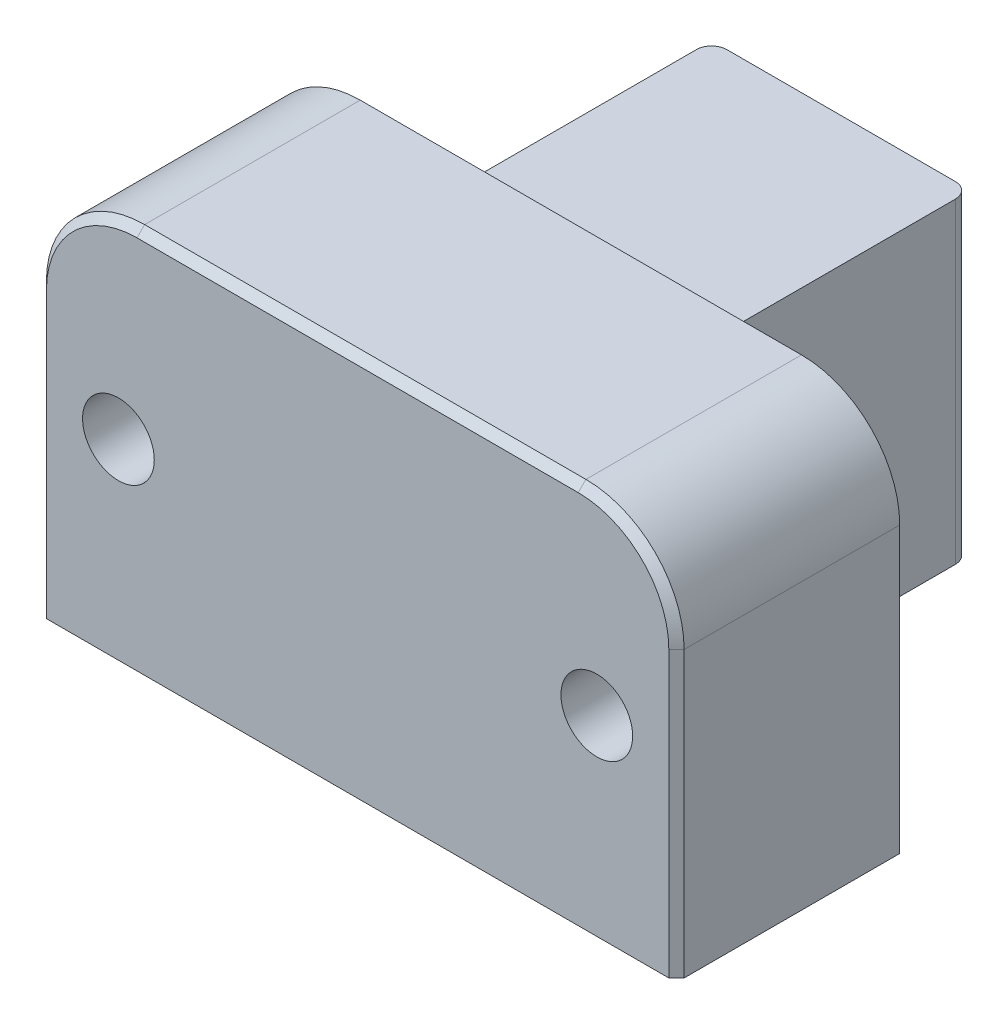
ISO-10303-21;
HEADER;
FILE_DESCRIPTION(('STEP AP214'),'2;1');
FILE_NAME('part.step','',(''),(''),'','','');
FILE_SCHEMA(('AUTOMOTIVE_DESIGN { 1 0 10303 214 1 1 1 1 }'));
ENDSEC;
DATA;
#1=APPLICATION_CONTEXT('core data for automotive mechanical design processes');
#2=APPLICATION_PROTOCOL_DEFINITION('international standard','automotive_design',2000,#1);
#3=PRODUCT_CONTEXT('',#1,'mechanical');
#4=PRODUCT('Part','Part','',(#3));
#5=PRODUCT_RELATED_PRODUCT_CATEGORY('part','',(#4));
#6=PRODUCT_DEFINITION_FORMATION('','',#4);
#7=PRODUCT_DEFINITION_CONTEXT('part definition',#1,'design');
#8=PRODUCT_DEFINITION('design','',#6,#7);
#9=PRODUCT_DEFINITION_SHAPE('','',#8);
#10=(LENGTH_UNIT() NAMED_UNIT(*) SI_UNIT(.MILLI.,.METRE.));
#11=(NAMED_UNIT(*) PLANE_ANGLE_UNIT() SI_UNIT($,.RADIAN.));
#12=(NAMED_UNIT(*) SI_UNIT($,.STERADIAN.) SOLID_ANGLE_UNIT());
#13=UNCERTAINTY_MEASURE_WITH_UNIT(LENGTH_MEASURE(1.E-05),#10,'distance_accuracy_value','');
#14=(GEOMETRIC_REPRESENTATION_CONTEXT(3) GLOBAL_UNCERTAINTY_ASSIGNED_CONTEXT((#13)) GLOBAL_UNIT_ASSIGNED_CONTEXT((#10,
#11,#12)) REPRESENTATION_CONTEXT('',''));
#15=CARTESIAN_POINT('',(0.,0.,0.));
#16=DIRECTION('',(0.,0.,1.));
#17=DIRECTION('',(1.,0.,0.));
#18=AXIS2_PLACEMENT_3D('',#15,#16,#17);
#19=CARTESIAN_POINT('',(-31.74365,38.1,0.));
#20=DIRECTION('',(1.,0.,0.));
#21=DIRECTION('',(0.,0.,-1.));
#22=AXIS2_PLACEMENT_3D('',#19,#20,#21);
#23=PLANE('',#22);
#24=DIRECTION('',(0.,0.,1.));
#25=VECTOR('',#24,1.);
#26=CARTESIAN_POINT('',(-31.74365,0.,0.));
#27=LINE('',#26,#25);
#28=CARTESIAN_POINT('',(-31.74365,0.,0.));
#29=VERTEX_POINT('',#28);
#30=CARTESIAN_POINT('',(-31.74365,0.,21.463));
#31=VERTEX_POINT('',#30);
#32=EDGE_CURVE('E178',#29,#31,#27,.T.);
#33=ORIENTED_EDGE('',*,*,#32,.T.);
#34=DIRECTION('',(0.,1.,0.));
#35=VECTOR('',#34,1.);
#36=CARTESIAN_POINT('',(-31.74365,38.1,21.463));
#37=LINE('',#36,#35);
#38=CARTESIAN_POINT('',(-31.74365,28.321,21.463));
#39=VERTEX_POINT('',#38);
#40=EDGE_CURVE('E252',#31,#39,#37,.T.);
#41=ORIENTED_EDGE('',*,*,#40,.T.);
#42=DIRECTION('',(0.,0.,1.));
#43=VECTOR('',#42,1.);
#44=CARTESIAN_POINT('',(-31.74365,28.321,0.));
#45=LINE('',#44,#43);
#46=CARTESIAN_POINT('',(-31.74365,28.321,0.));
#47=VERTEX_POINT('',#46);
#48=EDGE_CURVE('E235',#39,#47,#45,.F.);
#49=ORIENTED_EDGE('',*,*,#48,.T.);
#50=DIRECTION('',(0.,-1.,0.));
#51=VECTOR('',#50,1.);
#52=CARTESIAN_POINT('',(-31.74365,38.1,0.));
#53=LINE('',#52,#51);
#54=EDGE_CURVE('E173',#47,#29,#53,.T.);
#55=ORIENTED_EDGE('',*,*,#54,.T.);
#56=EDGE_LOOP('',(#33,#41,#49,#55));
#57=FACE_BOUND('',#56,.T.);
#58=ADVANCED_FACE('F32',(#57),#23,.F.);
#59=CARTESIAN_POINT('',(-31.74365,38.1,22.225));
#60=DIRECTION('',(0.,0.,-1.));
#61=DIRECTION('',(-1.,0.,0.));
#62=AXIS2_PLACEMENT_3D('',#59,#60,#61);
#63=PLANE('',#62);
#64=CARTESIAN_POINT('',(23.8125,19.05,22.225));
#65=DIRECTION('',(0.,0.,-1.));
#66=DIRECTION('',(-1.,0.,0.));
#67=AXIS2_PLACEMENT_3D('',#64,#65,#66);
#68=CIRCLE('',#67,3.5687);
#69=CARTESIAN_POINT('',(20.2438,19.05,22.225));
#70=VERTEX_POINT('',#69);
#71=EDGE_CURVE('E284',#70,#70,#68,.T.);
#72=ORIENTED_EDGE('',*,*,#71,.T.);
#73=EDGE_LOOP('',(#72));
#74=FACE_BOUND('',#73,.T.);
#75=CARTESIAN_POINT('',(-23.8125,19.05,22.225));
#76=DIRECTION('',(0.,0.,1.));
#77=DIRECTION('',(1.,0.,0.));
#78=AXIS2_PLACEMENT_3D('',#75,#76,#77);
#79=CIRCLE('',#78,3.5687);
#80=CARTESIAN_POINT('',(-20.2438,19.05,22.225));
#81=VERTEX_POINT('',#80);
#82=EDGE_CURVE('E296',#81,#81,#79,.T.);
#83=ORIENTED_EDGE('',*,*,#82,.F.);
#84=EDGE_LOOP('',(#83));
#85=FACE_BOUND('',#84,.T.);
#86=CARTESIAN_POINT('',(-21.96465,28.321,22.225));
#87=DIRECTION('',(0.,0.,-1.));
#88=DIRECTION('',(-1.,0.,0.));
#89=AXIS2_PLACEMENT_3D('',#86,#87,#88);
#90=CIRCLE('',#89,9.017);
#91=CARTESIAN_POINT('',(-21.96465,37.338,22.225));
#92=VERTEX_POINT('',#91);
#93=CARTESIAN_POINT('',(-30.98165,28.321,22.225));
#94=VERTEX_POINT('',#93);
#95=EDGE_CURVE('E243',#92,#94,#90,.F.);
#96=ORIENTED_EDGE('',*,*,#95,.T.);
#97=DIRECTION('',(0.,-1.,0.));
#98=VECTOR('',#97,1.);
#99=CARTESIAN_POINT('',(-30.98165,38.1,22.225));
#100=LINE('',#99,#98);
#101=CARTESIAN_POINT('',(-30.98165,0.,22.225));
#102=VERTEX_POINT('',#101);
#103=EDGE_CURVE('E245',#94,#102,#100,.T.);
#104=ORIENTED_EDGE('',*,*,#103,.T.);
#105=DIRECTION('',(1.,0.,0.));
#106=VECTOR('',#105,1.);
#107=CARTESIAN_POINT('',(-31.74365,0.,22.225));
#108=LINE('',#107,#106);
#109=CARTESIAN_POINT('',(30.98165,0.,22.225));
#110=VERTEX_POINT('',#109);
#111=EDGE_CURVE('E162',#102,#110,#108,.T.);
#112=ORIENTED_EDGE('',*,*,#111,.T.);
#113=DIRECTION('',(0.,1.,0.));
#114=VECTOR('',#113,1.);
#115=CARTESIAN_POINT('',(30.98165,38.1,22.225));
#116=LINE('',#115,#114);
#117=CARTESIAN_POINT('',(30.98165,28.321,22.225));
#118=VERTEX_POINT('',#117);
#119=EDGE_CURVE('E237',#110,#118,#116,.T.);
#120=ORIENTED_EDGE('',*,*,#119,.T.);
#121=CARTESIAN_POINT('',(21.96465,28.321,22.225));
#122=DIRECTION('',(0.,0.,-1.));
#123=DIRECTION('',(-1.,0.,0.));
#124=AXIS2_PLACEMENT_3D('',#121,#122,#123);
#125=CIRCLE('',#124,9.017);
#126=CARTESIAN_POINT('',(21.96465,37.338,22.225));
#127=VERTEX_POINT('',#126);
#128=EDGE_CURVE('E239',#118,#127,#125,.F.);
#129=ORIENTED_EDGE('',*,*,#128,.T.);
#130=DIRECTION('',(-1.,0.,0.));
#131=VECTOR('',#130,1.);
#132=CARTESIAN_POINT('',(-21.96465,37.338,22.225));
#133=LINE('',#132,#131);
#134=EDGE_CURVE('E241',#127,#92,#133,.T.);
#135=ORIENTED_EDGE('',*,*,#134,.T.);
#136=EDGE_LOOP('',(#96,#104,#112,#120,#129,#135));
#137=FACE_BOUND('',#136,.T.);
#138=ADVANCED_FACE('F322',(#74,#85,#137),#63,.F.);
#139=CARTESIAN_POINT('',(31.74365,38.1,0.));
#140=DIRECTION('',(-1.,0.,0.));
#141=DIRECTION('',(0.,0.,1.));
#142=AXIS2_PLACEMENT_3D('',#139,#140,#141);
#143=PLANE('',#142);
#144=DIRECTION('',(0.,0.,-1.));
#145=VECTOR('',#144,1.);
#146=CARTESIAN_POINT('',(31.74365,28.321,22.225));
#147=LINE('',#146,#145);
#148=CARTESIAN_POINT('',(31.74365,28.321,0.));
#149=VERTEX_POINT('',#148);
#150=CARTESIAN_POINT('',(31.74365,28.321,21.463));
#151=VERTEX_POINT('',#150);
#152=EDGE_CURVE('E233',#149,#151,#147,.F.);
#153=ORIENTED_EDGE('',*,*,#152,.T.);
#154=DIRECTION('',(0.,-1.,0.));
#155=VECTOR('',#154,1.);
#156=CARTESIAN_POINT('',(31.74365,38.1,21.463));
#157=LINE('',#156,#155);
#158=CARTESIAN_POINT('',(31.74365,0.,21.463));
#159=VERTEX_POINT('',#158);
#160=EDGE_CURVE('E11',#151,#159,#157,.T.);
#161=ORIENTED_EDGE('',*,*,#160,.T.);
#162=DIRECTION('',(0.,0.,-1.));
#163=VECTOR('',#162,1.);
#164=CARTESIAN_POINT('',(31.74365,0.,0.));
#165=LINE('',#164,#163);
#166=CARTESIAN_POINT('',(31.74365,0.,0.));
#167=VERTEX_POINT('',#166);
#168=EDGE_CURVE('E153',#159,#167,#165,.T.);
#169=ORIENTED_EDGE('',*,*,#168,.T.);
#170=DIRECTION('',(0.,-1.,0.));
#171=VECTOR('',#170,1.);
#172=CARTESIAN_POINT('',(31.74365,38.1,0.));
#173=LINE('',#172,#171);
#174=EDGE_CURVE('E156',#149,#167,#173,.T.);
#175=ORIENTED_EDGE('',*,*,#174,.F.);
#176=EDGE_LOOP('',(#153,#161,#169,#175));
#177=FACE_BOUND('',#176,.T.);
#178=ADVANCED_FACE('F155',(#177),#143,.F.);
#179=CARTESIAN_POINT('',(12.8905,38.1,-25.908));
#180=DIRECTION('',(-1.,0.,0.));
#181=DIRECTION('',(0.,0.,1.));
#182=AXIS2_PLACEMENT_3D('',#179,#180,#181);
#183=PLANE('',#182);
#184=DIRECTION('',(0.,0.,1.));
#185=VECTOR('',#184,1.);
#186=CARTESIAN_POINT('',(12.8905,34.798,-25.908));
#187=LINE('',#186,#185);
#188=CARTESIAN_POINT('',(12.8905,34.798,-24.384));
#189=VERTEX_POINT('',#188);
#190=CARTESIAN_POINT('',(12.8905,34.798,-0.787400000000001));
#191=VERTEX_POINT('',#190);
#192=EDGE_CURVE('E306',#189,#191,#187,.T.);
#193=ORIENTED_EDGE('',*,*,#192,.T.);
#194=DIRECTION('',(0.,-1.,0.));
#195=VECTOR('',#194,1.);
#196=CARTESIAN_POINT('',(12.8905,3.30199999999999,-0.787400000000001));
#197=LINE('',#196,#195);
#198=CARTESIAN_POINT('',(12.8905,3.302,-0.787400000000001));
#199=VERTEX_POINT('',#198);
#200=EDGE_CURVE('E213',#191,#199,#197,.T.);
#201=ORIENTED_EDGE('',*,*,#200,.T.);
#202=DIRECTION('',(0.,0.,-1.));
#203=VECTOR('',#202,1.);
#204=CARTESIAN_POINT('',(12.8905,3.302,-25.908));
#205=LINE('',#204,#203);
#206=CARTESIAN_POINT('',(12.8905,3.302,-24.384));
#207=VERTEX_POINT('',#206);
#208=EDGE_CURVE('E317',#199,#207,#205,.T.);
#209=ORIENTED_EDGE('',*,*,#208,.T.);
#210=DIRECTION('',(0.,-1.,0.));
#211=VECTOR('',#210,1.);
#212=CARTESIAN_POINT('',(12.8905,38.1,-24.384));
#213=LINE('',#212,#211);
#214=EDGE_CURVE('E195',#207,#189,#213,.F.);
#215=ORIENTED_EDGE('',*,*,#214,.T.);
#216=EDGE_LOOP('',(#193,#201,#209,#215));
#217=FACE_BOUND('',#216,.T.);
#218=ADVANCED_FACE('F400',(#217),#183,.F.);
#219=CARTESIAN_POINT('',(-12.8905,38.1,-25.908));
#220=DIRECTION('',(0.,0.,1.));
#221=DIRECTION('',(1.,0.,0.));
#222=AXIS2_PLACEMENT_3D('',#219,#220,#221);
#223=PLANE('',#222);
#224=DIRECTION('',(1.,0.,0.));
#225=VECTOR('',#224,1.);
#226=CARTESIAN_POINT('',(-12.8905,34.798,-25.908));
#227=LINE('',#226,#225);
#228=CARTESIAN_POINT('',(-11.3665,34.798,-25.908));
#229=VERTEX_POINT('',#228);
#230=CARTESIAN_POINT('',(11.3665,34.798,-25.908));
#231=VERTEX_POINT('',#230);
#232=EDGE_CURVE('E303',#229,#231,#227,.T.);
#233=ORIENTED_EDGE('',*,*,#232,.T.);
#234=DIRECTION('',(0.,-1.,0.));
#235=VECTOR('',#234,1.);
#236=CARTESIAN_POINT('',(11.3665,38.1,-25.908));
#237=LINE('',#236,#235);
#238=CARTESIAN_POINT('',(11.3665,3.302,-25.908));
#239=VERTEX_POINT('',#238);
#240=EDGE_CURVE('E187',#231,#239,#237,.T.);
#241=ORIENTED_EDGE('',*,*,#240,.T.);
#242=DIRECTION('',(-1.,0.,0.));
#243=VECTOR('',#242,1.);
#244=CARTESIAN_POINT('',(-12.8905,3.302,-25.908));
#245=LINE('',#244,#243);
#246=CARTESIAN_POINT('',(-11.3665,3.302,-25.908));
#247=VERTEX_POINT('',#246);
#248=EDGE_CURVE('E314',#239,#247,#245,.T.);
#249=ORIENTED_EDGE('',*,*,#248,.T.);
#250=DIRECTION('',(0.,-1.,0.));
#251=VECTOR('',#250,1.);
#252=CARTESIAN_POINT('',(-11.3665,38.1,-25.908));
#253=LINE('',#252,#251);
#254=EDGE_CURVE('E172',#247,#229,#253,.F.);
#255=ORIENTED_EDGE('',*,*,#254,.T.);
#256=EDGE_LOOP('',(#233,#241,#249,#255));
#257=FACE_BOUND('',#256,.T.);
#258=ADVANCED_FACE('F405',(#257),#223,.F.);
#259=CARTESIAN_POINT('',(-12.8905,38.1,-25.908));
#260=DIRECTION('',(1.,0.,0.));
#261=DIRECTION('',(0.,0.,-1.));
#262=AXIS2_PLACEMENT_3D('',#259,#260,#261);
#263=PLANE('',#262);
#264=DIRECTION('',(0.,0.,1.));
#265=VECTOR('',#264,1.);
#266=CARTESIAN_POINT('',(-12.8905,3.302,-25.908));
#267=LINE('',#266,#265);
#268=CARTESIAN_POINT('',(-12.8905,3.302,-24.384));
#269=VERTEX_POINT('',#268);
#270=CARTESIAN_POINT('',(-12.8905,3.302,-0.787400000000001));
#271=VERTEX_POINT('',#270);
#272=EDGE_CURVE('E311',#269,#271,#267,.T.);
#273=ORIENTED_EDGE('',*,*,#272,.T.);
#274=DIRECTION('',(0.,-1.,0.));
#275=VECTOR('',#274,1.);
#276=CARTESIAN_POINT('',(-12.8905,34.798,-0.7874));
#277=LINE('',#276,#275);
#278=CARTESIAN_POINT('',(-12.8905,34.798,-0.787400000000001));
#279=VERTEX_POINT('',#278);
#280=EDGE_CURVE('E211',#271,#279,#277,.F.);
#281=ORIENTED_EDGE('',*,*,#280,.T.);
#282=DIRECTION('',(0.,0.,-1.));
#283=VECTOR('',#282,1.);
#284=CARTESIAN_POINT('',(-12.8905,34.798,-25.908));
#285=LINE('',#284,#283);
#286=CARTESIAN_POINT('',(-12.8905,34.798,-24.384));
#287=VERTEX_POINT('',#286);
#288=EDGE_CURVE('E301',#279,#287,#285,.T.);
#289=ORIENTED_EDGE('',*,*,#288,.T.);
#290=DIRECTION('',(0.,-1.,0.));
#291=VECTOR('',#290,1.);
#292=CARTESIAN_POINT('',(-12.8905,38.1,-24.384));
#293=LINE('',#292,#291);
#294=EDGE_CURVE('E202',#287,#269,#293,.T.);
#295=ORIENTED_EDGE('',*,*,#294,.T.);
#296=EDGE_LOOP('',(#273,#281,#289,#295));
#297=FACE_BOUND('',#296,.T.);
#298=ADVANCED_FACE('F389',(#297),#263,.F.);
#299=CARTESIAN_POINT('',(-31.74365,38.1,0.));
#300=DIRECTION('',(0.,0.,1.));
#301=DIRECTION('',(1.,0.,0.));
#302=AXIS2_PLACEMENT_3D('',#299,#300,#301);
#303=PLANE('',#302);
#304=CARTESIAN_POINT('',(23.8125,19.05,0.));
#305=DIRECTION('',(0.,0.,-1.));
#306=DIRECTION('',(-1.,0.,0.));
#307=AXIS2_PLACEMENT_3D('',#304,#305,#306);
#308=CIRCLE('',#307,5.1562);
#309=CARTESIAN_POINT('',(18.6563,19.05,0.));
#310=VERTEX_POINT('',#309);
#311=EDGE_CURVE('E269',#310,#310,#308,.T.);
#312=ORIENTED_EDGE('',*,*,#311,.F.);
#313=EDGE_LOOP('',(#312));
#314=FACE_BOUND('',#313,.T.);
#315=CARTESIAN_POINT('',(-23.8125,19.05,0.));
#316=DIRECTION('',(0.,0.,1.));
#317=DIRECTION('',(1.,0.,0.));
#318=AXIS2_PLACEMENT_3D('',#315,#316,#317);
#319=CIRCLE('',#318,5.1562);
#320=CARTESIAN_POINT('',(-18.6563,19.05,0.));
#321=VERTEX_POINT('',#320);
#322=EDGE_CURVE('E287',#321,#321,#319,.T.);
#323=ORIENTED_EDGE('',*,*,#322,.T.);
#324=EDGE_LOOP('',(#323));
#325=FACE_BOUND('',#324,.T.);
#326=DIRECTION('',(0.,-1.,0.));
#327=VECTOR('',#326,1.);
#328=CARTESIAN_POINT('',(-13.6779,3.30199999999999,0.));
#329=LINE('',#328,#327);
#330=CARTESIAN_POINT('',(-13.6779,34.798,0.));
#331=VERTEX_POINT('',#330);
#332=CARTESIAN_POINT('',(-13.6779,3.30199999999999,0.));
#333=VERTEX_POINT('',#332);
#334=EDGE_CURVE('E208',#331,#333,#329,.T.);
#335=ORIENTED_EDGE('',*,*,#334,.T.);
#336=DIRECTION('',(1.,0.,0.));
#337=VECTOR('',#336,1.);
#338=CARTESIAN_POINT('',(-25.4,3.30199999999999,0.));
#339=LINE('',#338,#337);
#340=CARTESIAN_POINT('',(13.6779,3.30199999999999,0.));
#341=VERTEX_POINT('',#340);
#342=EDGE_CURVE('E309',#333,#341,#339,.T.);
#343=ORIENTED_EDGE('',*,*,#342,.T.);
#344=DIRECTION('',(0.,-1.,0.));
#345=VECTOR('',#344,1.);
#346=CARTESIAN_POINT('',(13.6779,34.798,0.));
#347=LINE('',#346,#345);
#348=CARTESIAN_POINT('',(13.6779,34.798,0.));
#349=VERTEX_POINT('',#348);
#350=EDGE_CURVE('E205',#341,#349,#347,.F.);
#351=ORIENTED_EDGE('',*,*,#350,.T.);
#352=DIRECTION('',(1.,0.,0.));
#353=VECTOR('',#352,1.);
#354=CARTESIAN_POINT('',(-25.4,34.798,0.));
#355=LINE('',#354,#353);
#356=EDGE_CURVE('E299',#331,#349,#355,.T.);
#357=ORIENTED_EDGE('',*,*,#356,.F.);
#358=EDGE_LOOP('',(#335,#343,#351,#357));
#359=FACE_BOUND('',#358,.T.);
#360=DIRECTION('',(-1.,0.,0.));
#361=VECTOR('',#360,1.);
#362=CARTESIAN_POINT('',(12.8905,38.1,0.));
#363=LINE('',#362,#361);
#364=CARTESIAN_POINT('',(21.96465,38.1,0.));
#365=VERTEX_POINT('',#364);
#366=CARTESIAN_POINT('',(-21.96465,38.1,0.));
#367=VERTEX_POINT('',#366);
#368=EDGE_CURVE('E179',#365,#367,#363,.T.);
#369=ORIENTED_EDGE('',*,*,#368,.F.);
#370=CARTESIAN_POINT('',(21.96465,28.321,0.));
#371=DIRECTION('',(0.,0.,1.));
#372=DIRECTION('',(1.,0.,0.));
#373=AXIS2_PLACEMENT_3D('',#370,#371,#372);
#374=CIRCLE('',#373,9.779);
#375=EDGE_CURVE('E171',#365,#149,#374,.F.);
#376=ORIENTED_EDGE('',*,*,#375,.T.);
#377=ORIENTED_EDGE('',*,*,#174,.T.);
#378=DIRECTION('',(-1.,0.,0.));
#379=VECTOR('',#378,1.);
#380=CARTESIAN_POINT('',(-31.74365,0.,0.));
#381=LINE('',#380,#379);
#382=EDGE_CURVE('E161',#167,#29,#381,.T.);
#383=ORIENTED_EDGE('',*,*,#382,.T.);
#384=ORIENTED_EDGE('',*,*,#54,.F.);
#385=CARTESIAN_POINT('',(-21.96465,28.321,0.));
#386=DIRECTION('',(0.,0.,1.));
#387=DIRECTION('',(1.,0.,0.));
#388=AXIS2_PLACEMENT_3D('',#385,#386,#387);
#389=CIRCLE('',#388,9.779);
#390=EDGE_CURVE('E230',#47,#367,#389,.F.);
#391=ORIENTED_EDGE('',*,*,#390,.T.);
#392=EDGE_LOOP('',(#369,#376,#377,#383,#384,#391));
#393=FACE_BOUND('',#392,.T.);
#394=ADVANCED_FACE('F167',(#314,#325,#359,#393),#303,.F.);
#395=CARTESIAN_POINT('',(-31.74365,38.1,22.225));
#396=DIRECTION('',(0.,1.,0.));
#397=DIRECTION('',(0.,0.,1.));
#398=AXIS2_PLACEMENT_3D('',#395,#396,#397);
#399=PLANE('',#398);
#400=DIRECTION('',(0.,0.,1.));
#401=VECTOR('',#400,1.);
#402=CARTESIAN_POINT('',(-21.96465,38.1,22.225));
#403=LINE('',#402,#401);
#404=CARTESIAN_POINT('',(-21.96465,38.1,21.463));
#405=VERTEX_POINT('',#404);
#406=EDGE_CURVE('E226',#367,#405,#403,.T.);
#407=ORIENTED_EDGE('',*,*,#406,.T.);
#408=DIRECTION('',(1.,0.,0.));
#409=VECTOR('',#408,1.);
#410=CARTESIAN_POINT('',(21.96465,38.1,21.463));
#411=LINE('',#410,#409);
#412=CARTESIAN_POINT('',(21.96465,38.1,21.463));
#413=VERTEX_POINT('',#412);
#414=EDGE_CURVE('E56',#405,#413,#411,.T.);
#415=ORIENTED_EDGE('',*,*,#414,.T.);
#416=DIRECTION('',(0.,0.,-1.));
#417=VECTOR('',#416,1.);
#418=CARTESIAN_POINT('',(21.96465,38.1,0.));
#419=LINE('',#418,#417);
#420=EDGE_CURVE('E228',#413,#365,#419,.T.);
#421=ORIENTED_EDGE('',*,*,#420,.T.);
#422=ORIENTED_EDGE('',*,*,#368,.T.);
#423=EDGE_LOOP('',(#407,#415,#421,#422));
#424=FACE_BOUND('',#423,.T.);
#425=ADVANCED_FACE('F342',(#424),#399,.T.);
#426=CARTESIAN_POINT('',(-31.74365,0.,22.225));
#427=DIRECTION('',(0.,1.,0.));
#428=DIRECTION('',(0.,0.,1.));
#429=AXIS2_PLACEMENT_3D('',#426,#427,#428);
#430=PLANE('',#429);
#431=ORIENTED_EDGE('',*,*,#111,.F.);
#432=DIRECTION('',(0.707106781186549,0.,0.707106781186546));
#433=VECTOR('',#432,1.);
#434=CARTESIAN_POINT('',(-30.98165,0.,22.225));
#435=LINE('',#434,#433);
#436=EDGE_CURVE('E250',#102,#31,#435,.F.);
#437=ORIENTED_EDGE('',*,*,#436,.T.);
#438=ORIENTED_EDGE('',*,*,#32,.F.);
#439=ORIENTED_EDGE('',*,*,#382,.F.);
#440=ORIENTED_EDGE('',*,*,#168,.F.);
#441=DIRECTION('',(0.707106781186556,0.,-0.707106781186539));
#442=VECTOR('',#441,1.);
#443=CARTESIAN_POINT('',(31.74365,0.,21.463));
#444=LINE('',#443,#442);
#445=EDGE_CURVE('E248',#159,#110,#444,.F.);
#446=ORIENTED_EDGE('',*,*,#445,.T.);
#447=EDGE_LOOP('',(#431,#437,#438,#439,#440,#446));
#448=FACE_BOUND('',#447,.T.);
#449=ADVANCED_FACE('F176',(#448),#430,.F.);
#450=CARTESIAN_POINT('',(-25.4,3.302,-50.8));
#451=DIRECTION('',(0.,1.,0.));
#452=DIRECTION('',(0.,0.,1.));
#453=AXIS2_PLACEMENT_3D('',#450,#451,#452);
#454=PLANE('',#453);
#455=ORIENTED_EDGE('',*,*,#248,.F.);
#456=CARTESIAN_POINT('',(11.3665,3.302,-24.384));
#457=DIRECTION('',(0.,1.,0.));
#458=DIRECTION('',(0.,0.,1.));
#459=AXIS2_PLACEMENT_3D('',#456,#457,#458);
#460=CIRCLE('',#459,1.524);
#461=EDGE_CURVE('E192',#239,#207,#460,.F.);
#462=ORIENTED_EDGE('',*,*,#461,.T.);
#463=ORIENTED_EDGE('',*,*,#208,.F.);
#464=CARTESIAN_POINT('',(13.6779,3.30199999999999,-0.787400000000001));
#465=DIRECTION('',(0.,1.,0.));
#466=DIRECTION('',(0.,0.,1.));
#467=AXIS2_PLACEMENT_3D('',#464,#465,#466);
#468=CIRCLE('',#467,0.7874);
#469=EDGE_CURVE('E221',#199,#341,#468,.T.);
#470=ORIENTED_EDGE('',*,*,#469,.T.);
#471=ORIENTED_EDGE('',*,*,#342,.F.);
#472=CARTESIAN_POINT('',(-13.6779,3.30199999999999,-0.7874));
#473=DIRECTION('',(0.,1.,0.));
#474=DIRECTION('',(0.,0.,1.));
#475=AXIS2_PLACEMENT_3D('',#472,#473,#474);
#476=CIRCLE('',#475,0.7874);
#477=EDGE_CURVE('E216',#333,#271,#476,.T.);
#478=ORIENTED_EDGE('',*,*,#477,.T.);
#479=ORIENTED_EDGE('',*,*,#272,.F.);
#480=CARTESIAN_POINT('',(-11.3665,3.302,-24.384));
#481=DIRECTION('',(0.,1.,0.));
#482=DIRECTION('',(0.,0.,1.));
#483=AXIS2_PLACEMENT_3D('',#480,#481,#482);
#484=CIRCLE('',#483,1.524);
#485=EDGE_CURVE('E190',#269,#247,#484,.F.);
#486=ORIENTED_EDGE('',*,*,#485,.T.);
#487=EDGE_LOOP('',(#455,#462,#463,#470,#471,#478,#479,#486));
#488=FACE_BOUND('',#487,.T.);
#489=ADVANCED_FACE('F393',(#488),#454,.F.);
#490=CARTESIAN_POINT('',(-25.4,34.798,-50.8));
#491=DIRECTION('',(0.,-1.,0.));
#492=DIRECTION('',(0.,0.,-1.));
#493=AXIS2_PLACEMENT_3D('',#490,#491,#492);
#494=PLANE('',#493);
#495=ORIENTED_EDGE('',*,*,#192,.F.);
#496=CARTESIAN_POINT('',(11.3665,34.798,-24.384));
#497=DIRECTION('',(0.,-1.,0.));
#498=DIRECTION('',(0.,0.,-1.));
#499=AXIS2_PLACEMENT_3D('',#496,#497,#498);
#500=CIRCLE('',#499,1.524);
#501=EDGE_CURVE('E200',#189,#231,#500,.F.);
#502=ORIENTED_EDGE('',*,*,#501,.T.);
#503=ORIENTED_EDGE('',*,*,#232,.F.);
#504=CARTESIAN_POINT('',(-11.3665,34.798,-24.384));
#505=DIRECTION('',(0.,-1.,0.));
#506=DIRECTION('',(0.,0.,-1.));
#507=AXIS2_PLACEMENT_3D('',#504,#505,#506);
#508=CIRCLE('',#507,1.524);
#509=EDGE_CURVE('E197',#229,#287,#508,.F.);
#510=ORIENTED_EDGE('',*,*,#509,.T.);
#511=ORIENTED_EDGE('',*,*,#288,.F.);
#512=CARTESIAN_POINT('',(-13.6779,34.798,-0.7874));
#513=DIRECTION('',(0.,-1.,0.));
#514=DIRECTION('',(0.,0.,-1.));
#515=AXIS2_PLACEMENT_3D('',#512,#513,#514);
#516=CIRCLE('',#515,0.7874);
#517=EDGE_CURVE('E218',#279,#331,#516,.T.);
#518=ORIENTED_EDGE('',*,*,#517,.T.);
#519=ORIENTED_EDGE('',*,*,#356,.T.);
#520=CARTESIAN_POINT('',(13.6779,34.798,-0.787400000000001));
#521=DIRECTION('',(0.,-1.,0.));
#522=DIRECTION('',(0.,0.,-1.));
#523=AXIS2_PLACEMENT_3D('',#520,#521,#522);
#524=CIRCLE('',#523,0.7874);
#525=EDGE_CURVE('E224',#349,#191,#524,.T.);
#526=ORIENTED_EDGE('',*,*,#525,.T.);
#527=EDGE_LOOP('',(#495,#502,#503,#510,#511,#518,#519,#526));
#528=FACE_BOUND('',#527,.T.);
#529=ADVANCED_FACE('F369',(#528),#494,.F.);
#530=CARTESIAN_POINT('',(11.3665,38.1,-24.384));
#531=DIRECTION('',(0.,-1.,0.));
#532=DIRECTION('',(0.,0.,-1.));
#533=AXIS2_PLACEMENT_3D('',#530,#531,#532);
#534=CYLINDRICAL_SURFACE('',#533,1.524);
#535=ORIENTED_EDGE('',*,*,#501,.F.);
#536=ORIENTED_EDGE('',*,*,#214,.F.);
#537=ORIENTED_EDGE('',*,*,#461,.F.);
#538=ORIENTED_EDGE('',*,*,#240,.F.);
#539=EDGE_LOOP('',(#535,#536,#537,#538));
#540=FACE_BOUND('',#539,.T.);
#541=ADVANCED_FACE('F365',(#540),#534,.T.);
#542=CARTESIAN_POINT('',(-11.3665,38.1,-24.384));
#543=DIRECTION('',(0.,-1.,0.));
#544=DIRECTION('',(0.,0.,-1.));
#545=AXIS2_PLACEMENT_3D('',#542,#543,#544);
#546=CYLINDRICAL_SURFACE('',#545,1.524);
#547=ORIENTED_EDGE('',*,*,#509,.F.);
#548=ORIENTED_EDGE('',*,*,#254,.F.);
#549=ORIENTED_EDGE('',*,*,#485,.F.);
#550=ORIENTED_EDGE('',*,*,#294,.F.);
#551=EDGE_LOOP('',(#547,#548,#549,#550));
#552=FACE_BOUND('',#551,.T.);
#553=ADVANCED_FACE('F368',(#552),#546,.T.);
#554=CARTESIAN_POINT('',(-13.6779,38.1,-0.7874));
#555=DIRECTION('',(0.,1.,0.));
#556=DIRECTION('',(0.,0.,1.));
#557=AXIS2_PLACEMENT_3D('',#554,#555,#556);
#558=CYLINDRICAL_SURFACE('',#557,0.7874);
#559=ORIENTED_EDGE('',*,*,#517,.F.);
#560=ORIENTED_EDGE('',*,*,#280,.F.);
#561=ORIENTED_EDGE('',*,*,#477,.F.);
#562=ORIENTED_EDGE('',*,*,#334,.F.);
#563=EDGE_LOOP('',(#559,#560,#561,#562));
#564=FACE_BOUND('',#563,.T.);
#565=ADVANCED_FACE('F353',(#564),#558,.F.);
#566=CARTESIAN_POINT('',(13.6779,38.1,-0.787400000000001));
#567=DIRECTION('',(0.,1.,0.));
#568=DIRECTION('',(0.,0.,1.));
#569=AXIS2_PLACEMENT_3D('',#566,#567,#568);
#570=CYLINDRICAL_SURFACE('',#569,0.7874);
#571=ORIENTED_EDGE('',*,*,#525,.F.);
#572=ORIENTED_EDGE('',*,*,#350,.F.);
#573=ORIENTED_EDGE('',*,*,#469,.F.);
#574=ORIENTED_EDGE('',*,*,#200,.F.);
#575=EDGE_LOOP('',(#571,#572,#573,#574));
#576=FACE_BOUND('',#575,.T.);
#577=ADVANCED_FACE('F345',(#576),#570,.F.);
#578=CARTESIAN_POINT('',(21.96465,28.321,22.225));
#579=DIRECTION('',(0.,0.,1.));
#580=DIRECTION('',(1.,0.,0.));
#581=AXIS2_PLACEMENT_3D('',#578,#579,#580);
#582=CYLINDRICAL_SURFACE('',#581,9.779);
#583=ORIENTED_EDGE('',*,*,#420,.F.);
#584=CARTESIAN_POINT('',(21.96465,28.321,21.463));
#585=DIRECTION('',(0.,0.,-1.));
#586=DIRECTION('',(-1.,0.,0.));
#587=AXIS2_PLACEMENT_3D('',#584,#585,#586);
#588=CIRCLE('',#587,9.779);
#589=EDGE_CURVE('E41',#413,#151,#588,.T.);
#590=ORIENTED_EDGE('',*,*,#589,.T.);
#591=ORIENTED_EDGE('',*,*,#152,.F.);
#592=ORIENTED_EDGE('',*,*,#375,.F.);
#593=EDGE_LOOP('',(#583,#590,#591,#592));
#594=FACE_BOUND('',#593,.T.);
#595=ADVANCED_FACE('F343',(#594),#582,.T.);
#596=CARTESIAN_POINT('',(-21.96465,28.321,22.225));
#597=DIRECTION('',(0.,0.,-1.));
#598=DIRECTION('',(-1.,0.,0.));
#599=AXIS2_PLACEMENT_3D('',#596,#597,#598);
#600=CYLINDRICAL_SURFACE('',#599,9.779);
#601=ORIENTED_EDGE('',*,*,#48,.F.);
#602=CARTESIAN_POINT('',(-21.96465,28.321,21.463));
#603=DIRECTION('',(0.,0.,-1.));
#604=DIRECTION('',(-1.,0.,0.));
#605=AXIS2_PLACEMENT_3D('',#602,#603,#604);
#606=CIRCLE('',#605,9.779);
#607=EDGE_CURVE('E254',#39,#405,#606,.T.);
#608=ORIENTED_EDGE('',*,*,#607,.T.);
#609=ORIENTED_EDGE('',*,*,#406,.F.);
#610=ORIENTED_EDGE('',*,*,#390,.F.);
#611=EDGE_LOOP('',(#601,#608,#609,#610));
#612=FACE_BOUND('',#611,.T.);
#613=ADVANCED_FACE('F341',(#612),#600,.T.);
#614=CARTESIAN_POINT('',(-23.8125,19.05,26.865158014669));
#615=DIRECTION('',(0.,0.,1.));
#616=DIRECTION('',(1.,0.,0.));
#617=AXIS2_PLACEMENT_3D('',#614,#615,#616);
#618=CYLINDRICAL_SURFACE('',#617,3.5687);
#619=CARTESIAN_POINT('',(-23.8125,19.05,6.7564));
#620=DIRECTION('',(0.,0.,1.));
#621=DIRECTION('',(1.,0.,0.));
#622=AXIS2_PLACEMENT_3D('',#619,#620,#621);
#623=CIRCLE('',#622,3.5687);
#624=CARTESIAN_POINT('',(-20.2438,19.05,6.7564));
#625=VERTEX_POINT('',#624);
#626=EDGE_CURVE('E293',#625,#625,#623,.T.);
#627=ORIENTED_EDGE('',*,*,#626,.F.);
#628=EDGE_LOOP('',(#627));
#629=FACE_BOUND('',#628,.T.);
#630=ORIENTED_EDGE('',*,*,#82,.T.);
#631=EDGE_LOOP('',(#630));
#632=FACE_BOUND('',#631,.T.);
#633=ADVANCED_FACE('F351',(#629,#632),#618,.F.);
#634=CARTESIAN_POINT('',(-20.2438,19.05,6.7564));
#635=DIRECTION('',(0.,0.,1.));
#636=DIRECTION('',(1.,0.,0.));
#637=AXIS2_PLACEMENT_3D('',#634,#635,#636);
#638=PLANE('',#637);
#639=CARTESIAN_POINT('',(-23.8125,19.05,6.7564));
#640=DIRECTION('',(0.,0.,1.));
#641=DIRECTION('',(1.,0.,0.));
#642=AXIS2_PLACEMENT_3D('',#639,#640,#641);
#643=CIRCLE('',#642,5.1562);
#644=CARTESIAN_POINT('',(-18.6563,19.05,6.7564));
#645=VERTEX_POINT('',#644);
#646=EDGE_CURVE('E290',#645,#645,#643,.T.);
#647=ORIENTED_EDGE('',*,*,#646,.F.);
#648=EDGE_LOOP('',(#647));
#649=FACE_BOUND('',#648,.T.);
#650=ORIENTED_EDGE('',*,*,#626,.T.);
#651=EDGE_LOOP('',(#650));
#652=FACE_BOUND('',#651,.T.);
#653=ADVANCED_FACE('F478',(#649,#652),#638,.F.);
#654=CARTESIAN_POINT('',(-23.8125,19.05,26.865158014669));
#655=DIRECTION('',(0.,0.,1.));
#656=DIRECTION('',(1.,0.,0.));
#657=AXIS2_PLACEMENT_3D('',#654,#655,#656);
#658=CYLINDRICAL_SURFACE('',#657,5.1562);
#659=ORIENTED_EDGE('',*,*,#322,.F.);
#660=EDGE_LOOP('',(#659));
#661=FACE_BOUND('',#660,.T.);
#662=ORIENTED_EDGE('',*,*,#646,.T.);
#663=EDGE_LOOP('',(#662));
#664=FACE_BOUND('',#663,.T.);
#665=ADVANCED_FACE('F489',(#661,#664),#658,.F.);
#666=CARTESIAN_POINT('',(23.8125,19.05,26.865158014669));
#667=DIRECTION('',(0.,0.,1.));
#668=DIRECTION('',(-1.,0.,0.));
#669=AXIS2_PLACEMENT_3D('',#666,#667,#668);
#670=CYLINDRICAL_SURFACE('',#669,3.5687);
#671=CARTESIAN_POINT('',(23.8125,19.05,6.7564));
#672=DIRECTION('',(0.,0.,-1.));
#673=DIRECTION('',(-1.,0.,0.));
#674=AXIS2_PLACEMENT_3D('',#671,#672,#673);
#675=CIRCLE('',#674,3.5687);
#676=CARTESIAN_POINT('',(20.2438,19.05,6.7564));
#677=VERTEX_POINT('',#676);
#678=EDGE_CURVE('E279',#677,#677,#675,.T.);
#679=ORIENTED_EDGE('',*,*,#678,.T.);
#680=EDGE_LOOP('',(#679));
#681=FACE_BOUND('',#680,.T.);
#682=ORIENTED_EDGE('',*,*,#71,.F.);
#683=EDGE_LOOP('',(#682));
#684=FACE_BOUND('',#683,.T.);
#685=ADVANCED_FACE('F499',(#681,#684),#670,.F.);
#686=CARTESIAN_POINT('',(20.2438,19.05,6.7564));
#687=DIRECTION('',(0.,0.,1.));
#688=DIRECTION('',(-1.,0.,0.));
#689=AXIS2_PLACEMENT_3D('',#686,#687,#688);
#690=PLANE('',#689);
#691=CARTESIAN_POINT('',(23.8125,19.05,6.7564));
#692=DIRECTION('',(0.,0.,-1.));
#693=DIRECTION('',(-1.,0.,0.));
#694=AXIS2_PLACEMENT_3D('',#691,#692,#693);
#695=CIRCLE('',#694,5.1562);
#696=CARTESIAN_POINT('',(18.6563,19.05,6.7564));
#697=VERTEX_POINT('',#696);
#698=EDGE_CURVE('E274',#697,#697,#695,.T.);
#699=ORIENTED_EDGE('',*,*,#698,.T.);
#700=EDGE_LOOP('',(#699));
#701=FACE_BOUND('',#700,.T.);
#702=ORIENTED_EDGE('',*,*,#678,.F.);
#703=EDGE_LOOP('',(#702));
#704=FACE_BOUND('',#703,.T.);
#705=ADVANCED_FACE('F517',(#701,#704),#690,.F.);
#706=CARTESIAN_POINT('',(23.8125,19.05,26.865158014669));
#707=DIRECTION('',(0.,0.,1.));
#708=DIRECTION('',(-1.,0.,0.));
#709=AXIS2_PLACEMENT_3D('',#706,#707,#708);
#710=CYLINDRICAL_SURFACE('',#709,5.1562);
#711=ORIENTED_EDGE('',*,*,#311,.T.);
#712=EDGE_LOOP('',(#711));
#713=FACE_BOUND('',#712,.T.);
#714=ORIENTED_EDGE('',*,*,#698,.F.);
#715=EDGE_LOOP('',(#714));
#716=FACE_BOUND('',#715,.T.);
#717=ADVANCED_FACE('F527',(#713,#716),#710,.F.);
#718=CARTESIAN_POINT('',(31.74365,38.1,21.463));
#719=DIRECTION('',(-0.707106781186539,0.,-0.707106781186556));
#720=DIRECTION('',(-0.707106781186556,0.,0.707106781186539));
#721=AXIS2_PLACEMENT_3D('',#718,#719,#720);
#722=PLANE('',#721);
#723=ORIENTED_EDGE('',*,*,#445,.F.);
#724=ORIENTED_EDGE('',*,*,#160,.F.);
#725=DIRECTION('',(0.707106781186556,0.,-0.707106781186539));
#726=VECTOR('',#725,1.);
#727=CARTESIAN_POINT('',(30.98165,28.321,22.225));
#728=LINE('',#727,#726);
#729=EDGE_CURVE('E36',#118,#151,#728,.T.);
#730=ORIENTED_EDGE('',*,*,#729,.F.);
#731=ORIENTED_EDGE('',*,*,#119,.F.);
#732=EDGE_LOOP('',(#723,#724,#730,#731));
#733=FACE_BOUND('',#732,.T.);
#734=ADVANCED_FACE('F34',(#733),#722,.F.);
#735=CARTESIAN_POINT('',(21.96465,28.321,22.225));
#736=DIRECTION('',(0.,0.,-1.));
#737=DIRECTION('',(-1.,0.,0.));
#738=AXIS2_PLACEMENT_3D('',#735,#736,#737);
#739=CONICAL_SURFACE('',#738,9.017,0.785398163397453);
#740=ORIENTED_EDGE('',*,*,#729,.T.);
#741=ORIENTED_EDGE('',*,*,#589,.F.);
#742=DIRECTION('',(0.,0.707106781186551,-0.707106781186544));
#743=VECTOR('',#742,1.);
#744=CARTESIAN_POINT('',(21.96465,37.338,22.225));
#745=LINE('',#744,#743);
#746=EDGE_CURVE('E263',#127,#413,#745,.T.);
#747=ORIENTED_EDGE('',*,*,#746,.F.);
#748=ORIENTED_EDGE('',*,*,#128,.F.);
#749=EDGE_LOOP('',(#740,#741,#747,#748));
#750=FACE_BOUND('',#749,.T.);
#751=ADVANCED_FACE('F325',(#750),#739,.T.);
#752=CARTESIAN_POINT('',(-31.74365,38.1,21.463));
#753=DIRECTION('',(0.,0.707106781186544,0.707106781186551));
#754=DIRECTION('',(0.,-0.707106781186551,0.707106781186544));
#755=AXIS2_PLACEMENT_3D('',#752,#753,#754);
#756=PLANE('',#755);
#757=ORIENTED_EDGE('',*,*,#746,.T.);
#758=ORIENTED_EDGE('',*,*,#414,.F.);
#759=DIRECTION('',(0.,0.707106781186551,-0.707106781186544));
#760=VECTOR('',#759,1.);
#761=CARTESIAN_POINT('',(-21.96465,37.338,22.225));
#762=LINE('',#761,#760);
#763=EDGE_CURVE('E261',#92,#405,#762,.T.);
#764=ORIENTED_EDGE('',*,*,#763,.F.);
#765=ORIENTED_EDGE('',*,*,#134,.F.);
#766=EDGE_LOOP('',(#757,#758,#764,#765));
#767=FACE_BOUND('',#766,.T.);
#768=ADVANCED_FACE('F329',(#767),#756,.T.);
#769=CARTESIAN_POINT('',(-21.96465,28.321,22.225));
#770=DIRECTION('',(0.,0.,-1.));
#771=DIRECTION('',(-1.,0.,0.));
#772=AXIS2_PLACEMENT_3D('',#769,#770,#771);
#773=CONICAL_SURFACE('',#772,9.017,0.785398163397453);
#774=ORIENTED_EDGE('',*,*,#763,.T.);
#775=ORIENTED_EDGE('',*,*,#607,.F.);
#776=DIRECTION('',(-0.707106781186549,0.,-0.707106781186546));
#777=VECTOR('',#776,1.);
#778=CARTESIAN_POINT('',(-30.98165,28.321,22.225));
#779=LINE('',#778,#777);
#780=EDGE_CURVE('E258',#94,#39,#779,.T.);
#781=ORIENTED_EDGE('',*,*,#780,.F.);
#782=ORIENTED_EDGE('',*,*,#95,.F.);
#783=EDGE_LOOP('',(#774,#775,#781,#782));
#784=FACE_BOUND('',#783,.T.);
#785=ADVANCED_FACE('F332',(#784),#773,.T.);
#786=CARTESIAN_POINT('',(-30.98165,38.1,22.225));
#787=DIRECTION('',(0.707106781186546,0.,-0.707106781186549));
#788=DIRECTION('',(-0.707106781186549,0.,-0.707106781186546));
#789=AXIS2_PLACEMENT_3D('',#786,#787,#788);
#790=PLANE('',#789);
#791=ORIENTED_EDGE('',*,*,#780,.T.);
#792=ORIENTED_EDGE('',*,*,#40,.F.);
#793=ORIENTED_EDGE('',*,*,#436,.F.);
#794=ORIENTED_EDGE('',*,*,#103,.F.);
#795=EDGE_LOOP('',(#791,#792,#793,#794));
#796=FACE_BOUND('',#795,.T.);
#797=ADVANCED_FACE('F335',(#796),#790,.F.);
#798=CLOSED_SHELL('',(#58,#138,#178,#218,#258,#298,#394,#425,#449,#489,#529,#541,#553,#565,#577,
#595,#613,#633,#653,#665,#685,#705,#717,#734,#751,#768,#785,#797));
#799=MANIFOLD_SOLID_BREP('B2',#798);
#800=ADVANCED_BREP_SHAPE_REPRESENTATION('',(#18,#799),#14);
#801=SHAPE_DEFINITION_REPRESENTATION(#9,#800);
ENDSEC;
END-ISO-10303-21;
